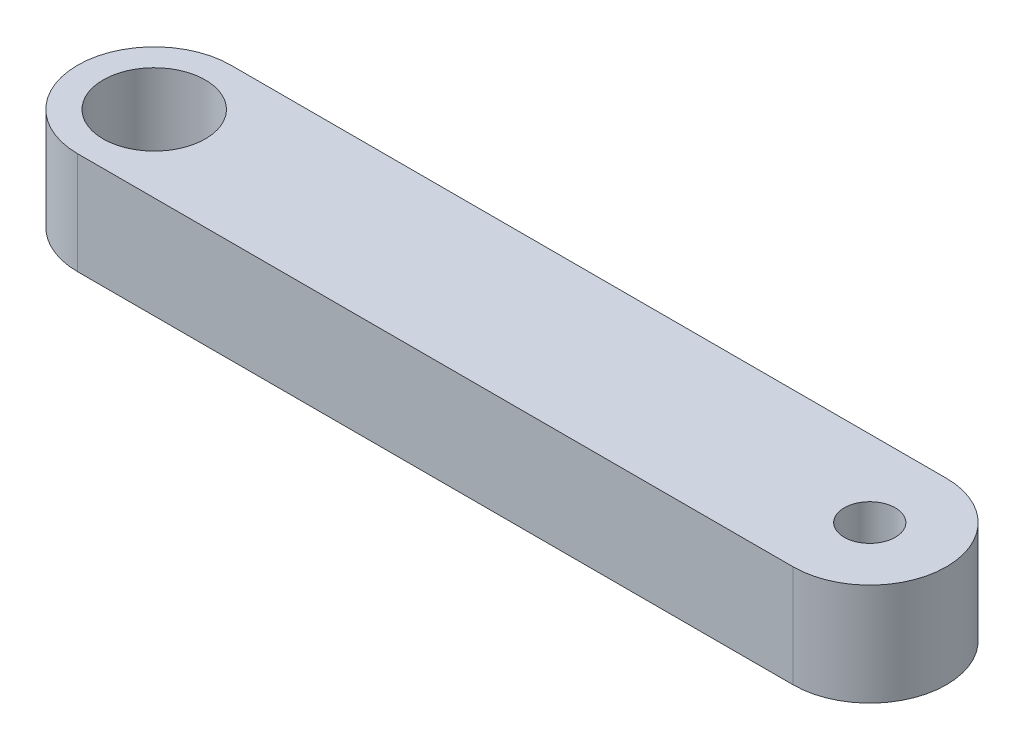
ISO-10303-21;
HEADER;
FILE_DESCRIPTION(('STEP AP214'),'2;1');
FILE_NAME('part.step','',(''),(''),'','','');
FILE_SCHEMA(('AUTOMOTIVE_DESIGN { 1 0 10303 214 1 1 1 1 }'));
ENDSEC;
DATA;
#1=APPLICATION_CONTEXT('core data for automotive mechanical design processes');
#2=APPLICATION_PROTOCOL_DEFINITION('international standard','automotive_design',2000,#1);
#3=PRODUCT_CONTEXT('',#1,'mechanical');
#4=PRODUCT('Part','Part','',(#3));
#5=PRODUCT_RELATED_PRODUCT_CATEGORY('part','',(#4));
#6=PRODUCT_DEFINITION_FORMATION('','',#4);
#7=PRODUCT_DEFINITION_CONTEXT('part definition',#1,'design');
#8=PRODUCT_DEFINITION('design','',#6,#7);
#9=PRODUCT_DEFINITION_SHAPE('','',#8);
#10=(LENGTH_UNIT() NAMED_UNIT(*) SI_UNIT(.MILLI.,.METRE.));
#11=(NAMED_UNIT(*) PLANE_ANGLE_UNIT() SI_UNIT($,.RADIAN.));
#12=(NAMED_UNIT(*) SI_UNIT($,.STERADIAN.) SOLID_ANGLE_UNIT());
#13=UNCERTAINTY_MEASURE_WITH_UNIT(LENGTH_MEASURE(1.E-05),#10,'distance_accuracy_value','');
#14=(GEOMETRIC_REPRESENTATION_CONTEXT(3) GLOBAL_UNCERTAINTY_ASSIGNED_CONTEXT((#13)) GLOBAL_UNIT_ASSIGNED_CONTEXT((#10,
#11,#12)) REPRESENTATION_CONTEXT('',''));
#15=CARTESIAN_POINT('',(0.,0.,0.));
#16=DIRECTION('',(0.,0.,1.));
#17=DIRECTION('',(1.,0.,0.));
#18=AXIS2_PLACEMENT_3D('',#15,#16,#17);
#19=CARTESIAN_POINT('',(0.,10.,0.));
#20=DIRECTION('',(0.,1.,0.));
#21=DIRECTION('',(0.,0.,1.));
#22=AXIS2_PLACEMENT_3D('',#19,#20,#21);
#23=PLANE('',#22);
#24=CARTESIAN_POINT('',(0.,10.,0.));
#25=DIRECTION('',(0.,1.,0.));
#26=DIRECTION('',(0.,0.,1.));
#27=AXIS2_PLACEMENT_3D('',#24,#25,#26);
#28=CIRCLE('',#27,5.);
#29=CARTESIAN_POINT('',(0.,10.,5.));
#30=VERTEX_POINT('',#29);
#31=EDGE_CURVE('E123',#30,#30,#28,.T.);
#32=ORIENTED_EDGE('',*,*,#31,.F.);
#33=EDGE_LOOP('',(#32));
#34=FACE_BOUND('',#33,.T.);
#35=CARTESIAN_POINT('',(0.,10.,0.));
#36=DIRECTION('',(0.,1.,0.));
#37=DIRECTION('',(0.,0.,1.));
#38=AXIS2_PLACEMENT_3D('',#35,#36,#37);
#39=CIRCLE('',#38,7.5);
#40=CARTESIAN_POINT('',(0.,10.,-7.5));
#41=VERTEX_POINT('',#40);
#42=CARTESIAN_POINT('',(0.,10.,7.5));
#43=VERTEX_POINT('',#42);
#44=EDGE_CURVE('E100',#41,#43,#39,.T.);
#45=ORIENTED_EDGE('',*,*,#44,.T.);
#46=DIRECTION('',(1.,0.,0.));
#47=VECTOR('',#46,1.);
#48=CARTESIAN_POINT('',(0.,10.,7.5));
#49=LINE('',#48,#47);
#50=CARTESIAN_POINT('',(70.,10.,7.5));
#51=VERTEX_POINT('',#50);
#52=EDGE_CURVE('E95',#43,#51,#49,.T.);
#53=ORIENTED_EDGE('',*,*,#52,.T.);
#54=CARTESIAN_POINT('',(70.,10.,0.));
#55=DIRECTION('',(0.,1.,0.));
#56=DIRECTION('',(0.,0.,1.));
#57=AXIS2_PLACEMENT_3D('',#54,#55,#56);
#58=CIRCLE('',#57,7.5);
#59=CARTESIAN_POINT('',(70.,10.,-7.5));
#60=VERTEX_POINT('',#59);
#61=EDGE_CURVE('E98',#51,#60,#58,.T.);
#62=ORIENTED_EDGE('',*,*,#61,.T.);
#63=DIRECTION('',(-1.,0.,0.));
#64=VECTOR('',#63,1.);
#65=CARTESIAN_POINT('',(0.,10.,-7.5));
#66=LINE('',#65,#64);
#67=EDGE_CURVE('E65',#60,#41,#66,.T.);
#68=ORIENTED_EDGE('',*,*,#67,.T.);
#69=EDGE_LOOP('',(#45,#53,#62,#68));
#70=FACE_BOUND('',#69,.T.);
#71=CARTESIAN_POINT('',(70.,10.,0.));
#72=DIRECTION('',(0.,1.,0.));
#73=DIRECTION('',(0.,0.,1.));
#74=AXIS2_PLACEMENT_3D('',#71,#72,#73);
#75=CIRCLE('',#74,2.5);
#76=CARTESIAN_POINT('',(70.,10.,2.5));
#77=VERTEX_POINT('',#76);
#78=EDGE_CURVE('E145',#77,#77,#75,.T.);
#79=ORIENTED_EDGE('',*,*,#78,.F.);
#80=EDGE_LOOP('',(#79));
#81=FACE_BOUND('',#80,.T.);
#82=ADVANCED_FACE('F47',(#34,#70,#81),#23,.T.);
#83=CARTESIAN_POINT('',(0.,0.,0.));
#84=DIRECTION('',(0.,1.,0.));
#85=DIRECTION('',(0.,0.,1.));
#86=AXIS2_PLACEMENT_3D('',#83,#84,#85);
#87=PLANE('',#86);
#88=CARTESIAN_POINT('',(0.,0.,0.));
#89=DIRECTION('',(0.,1.,0.));
#90=DIRECTION('',(0.,0.,1.));
#91=AXIS2_PLACEMENT_3D('',#88,#89,#90);
#92=CIRCLE('',#91,7.5);
#93=CARTESIAN_POINT('',(0.,0.,-7.5));
#94=VERTEX_POINT('',#93);
#95=CARTESIAN_POINT('',(0.,0.,7.5));
#96=VERTEX_POINT('',#95);
#97=EDGE_CURVE('E119',#94,#96,#92,.T.);
#98=ORIENTED_EDGE('',*,*,#97,.F.);
#99=DIRECTION('',(-1.,0.,0.));
#100=VECTOR('',#99,1.);
#101=CARTESIAN_POINT('',(0.,0.,-7.5));
#102=LINE('',#101,#100);
#103=CARTESIAN_POINT('',(70.,0.,-7.5));
#104=VERTEX_POINT('',#103);
#105=EDGE_CURVE('E88',#104,#94,#102,.T.);
#106=ORIENTED_EDGE('',*,*,#105,.F.);
#107=CARTESIAN_POINT('',(70.,0.,0.));
#108=DIRECTION('',(0.,1.,0.));
#109=DIRECTION('',(0.,0.,1.));
#110=AXIS2_PLACEMENT_3D('',#107,#108,#109);
#111=CIRCLE('',#110,7.5);
#112=CARTESIAN_POINT('',(70.,0.,7.5));
#113=VERTEX_POINT('',#112);
#114=EDGE_CURVE('E82',#113,#104,#111,.T.);
#115=ORIENTED_EDGE('',*,*,#114,.F.);
#116=DIRECTION('',(1.,0.,0.));
#117=VECTOR('',#116,1.);
#118=CARTESIAN_POINT('',(0.,0.,7.5));
#119=LINE('',#118,#117);
#120=EDGE_CURVE('E105',#96,#113,#119,.T.);
#121=ORIENTED_EDGE('',*,*,#120,.F.);
#122=EDGE_LOOP('',(#98,#106,#115,#121));
#123=FACE_BOUND('',#122,.T.);
#124=CARTESIAN_POINT('',(0.,0.,0.));
#125=DIRECTION('',(0.,1.,0.));
#126=DIRECTION('',(0.,0.,1.));
#127=AXIS2_PLACEMENT_3D('',#124,#125,#126);
#128=CIRCLE('',#127,5.);
#129=CARTESIAN_POINT('',(0.,0.,5.));
#130=VERTEX_POINT('',#129);
#131=EDGE_CURVE('E141',#130,#130,#128,.T.);
#132=ORIENTED_EDGE('',*,*,#131,.T.);
#133=EDGE_LOOP('',(#132));
#134=FACE_BOUND('',#133,.T.);
#135=CARTESIAN_POINT('',(70.,0.,0.));
#136=DIRECTION('',(0.,1.,0.));
#137=DIRECTION('',(0.,0.,1.));
#138=AXIS2_PLACEMENT_3D('',#135,#136,#137);
#139=CIRCLE('',#138,2.5);
#140=CARTESIAN_POINT('',(70.,0.,2.5));
#141=VERTEX_POINT('',#140);
#142=EDGE_CURVE('E149',#141,#141,#139,.T.);
#143=ORIENTED_EDGE('',*,*,#142,.T.);
#144=EDGE_LOOP('',(#143));
#145=FACE_BOUND('',#144,.T.);
#146=ADVANCED_FACE('F135',(#123,#134,#145),#87,.F.);
#147=CARTESIAN_POINT('',(0.,10.,0.));
#148=DIRECTION('',(0.,-1.,0.));
#149=DIRECTION('',(0.,0.,-1.));
#150=AXIS2_PLACEMENT_3D('',#147,#148,#149);
#151=CYLINDRICAL_SURFACE('',#150,7.5);
#152=ORIENTED_EDGE('',*,*,#97,.T.);
#153=DIRECTION('',(0.,-1.,0.));
#154=VECTOR('',#153,1.);
#155=CARTESIAN_POINT('',(0.,10.,7.5));
#156=LINE('',#155,#154);
#157=EDGE_CURVE('E11',#43,#96,#156,.T.);
#158=ORIENTED_EDGE('',*,*,#157,.F.);
#159=ORIENTED_EDGE('',*,*,#44,.F.);
#160=DIRECTION('',(0.,-1.,0.));
#161=VECTOR('',#160,1.);
#162=CARTESIAN_POINT('',(0.,10.,-7.5));
#163=LINE('',#162,#161);
#164=EDGE_CURVE('E115',#41,#94,#163,.T.);
#165=ORIENTED_EDGE('',*,*,#164,.T.);
#166=EDGE_LOOP('',(#152,#158,#159,#165));
#167=FACE_BOUND('',#166,.T.);
#168=ADVANCED_FACE('F49',(#167),#151,.T.);
#169=CARTESIAN_POINT('',(0.,10.,7.5));
#170=DIRECTION('',(0.,0.,-1.));
#171=DIRECTION('',(-1.,0.,0.));
#172=AXIS2_PLACEMENT_3D('',#169,#170,#171);
#173=PLANE('',#172);
#174=ORIENTED_EDGE('',*,*,#120,.T.);
#175=DIRECTION('',(0.,-1.,0.));
#176=VECTOR('',#175,1.);
#177=CARTESIAN_POINT('',(70.,10.,7.5));
#178=LINE('',#177,#176);
#179=EDGE_CURVE('E57',#51,#113,#178,.T.);
#180=ORIENTED_EDGE('',*,*,#179,.F.);
#181=ORIENTED_EDGE('',*,*,#52,.F.);
#182=ORIENTED_EDGE('',*,*,#157,.T.);
#183=EDGE_LOOP('',(#174,#180,#181,#182));
#184=FACE_BOUND('',#183,.T.);
#185=ADVANCED_FACE('F104',(#184),#173,.F.);
#186=CARTESIAN_POINT('',(70.,10.,0.));
#187=DIRECTION('',(0.,-1.,0.));
#188=DIRECTION('',(0.,0.,-1.));
#189=AXIS2_PLACEMENT_3D('',#186,#187,#188);
#190=CYLINDRICAL_SURFACE('',#189,7.5);
#191=ORIENTED_EDGE('',*,*,#114,.T.);
#192=DIRECTION('',(0.,-1.,0.));
#193=VECTOR('',#192,1.);
#194=CARTESIAN_POINT('',(70.,10.,-7.5));
#195=LINE('',#194,#193);
#196=EDGE_CURVE('E107',#60,#104,#195,.T.);
#197=ORIENTED_EDGE('',*,*,#196,.F.);
#198=ORIENTED_EDGE('',*,*,#61,.F.);
#199=ORIENTED_EDGE('',*,*,#179,.T.);
#200=EDGE_LOOP('',(#191,#197,#198,#199));
#201=FACE_BOUND('',#200,.T.);
#202=ADVANCED_FACE('F108',(#201),#190,.T.);
#203=CARTESIAN_POINT('',(0.,10.,-7.5));
#204=DIRECTION('',(0.,0.,1.));
#205=DIRECTION('',(1.,0.,0.));
#206=AXIS2_PLACEMENT_3D('',#203,#204,#205);
#207=PLANE('',#206);
#208=ORIENTED_EDGE('',*,*,#105,.T.);
#209=ORIENTED_EDGE('',*,*,#164,.F.);
#210=ORIENTED_EDGE('',*,*,#67,.F.);
#211=ORIENTED_EDGE('',*,*,#196,.T.);
#212=EDGE_LOOP('',(#208,#209,#210,#211));
#213=FACE_BOUND('',#212,.T.);
#214=ADVANCED_FACE('F132',(#213),#207,.F.);
#215=CARTESIAN_POINT('',(0.,10.,0.));
#216=DIRECTION('',(0.,-1.,0.));
#217=DIRECTION('',(0.,0.,-1.));
#218=AXIS2_PLACEMENT_3D('',#215,#216,#217);
#219=CYLINDRICAL_SURFACE('',#218,5.);
#220=ORIENTED_EDGE('',*,*,#31,.T.);
#221=EDGE_LOOP('',(#220));
#222=FACE_BOUND('',#221,.T.);
#223=ORIENTED_EDGE('',*,*,#131,.F.);
#224=EDGE_LOOP('',(#223));
#225=FACE_BOUND('',#224,.T.);
#226=ADVANCED_FACE('F169',(#222,#225),#219,.F.);
#227=CARTESIAN_POINT('',(70.,10.,0.));
#228=DIRECTION('',(0.,-1.,0.));
#229=DIRECTION('',(0.,0.,-1.));
#230=AXIS2_PLACEMENT_3D('',#227,#228,#229);
#231=CYLINDRICAL_SURFACE('',#230,2.5);
#232=ORIENTED_EDGE('',*,*,#78,.T.);
#233=EDGE_LOOP('',(#232));
#234=FACE_BOUND('',#233,.T.);
#235=ORIENTED_EDGE('',*,*,#142,.F.);
#236=EDGE_LOOP('',(#235));
#237=FACE_BOUND('',#236,.T.);
#238=ADVANCED_FACE('F158',(#234,#237),#231,.F.);
#239=CLOSED_SHELL('',(#82,#146,#168,#185,#202,#214,#226,#238));
#240=MANIFOLD_SOLID_BREP('B2',#239);
#241=ADVANCED_BREP_SHAPE_REPRESENTATION('',(#18,#240),#14);
#242=SHAPE_DEFINITION_REPRESENTATION(#9,#241);
ENDSEC;
END-ISO-10303-21;
